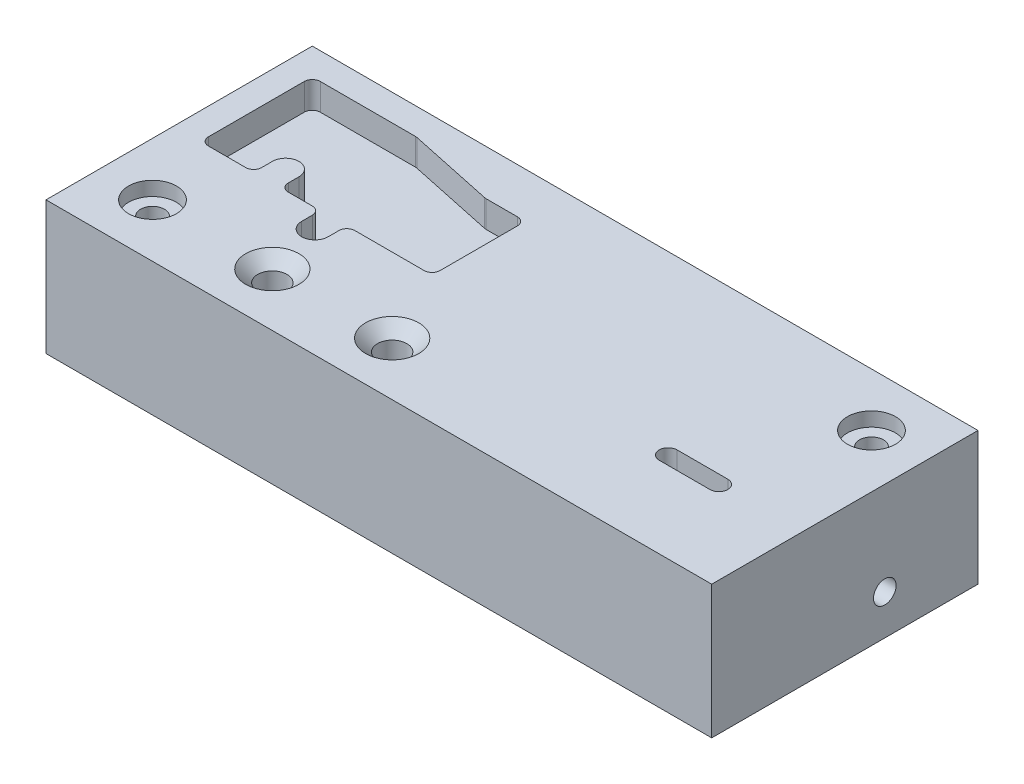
from build123d import *

# Parameters (mm, degrees)
SKETCH1_W                                            = 250
SKETCH1_H                                            = 100
BLOCK_STOCK_DEPTH                                    = 50
M10_TAPPED_HOLE1_D                                   = 8.5
M10_TAPPED_HOLE1_DEPTH                               = 25
M10_TAPPED_HOLE1_TIP                                 = 2.553657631
CBORE_FOR_M8_HEX_HEAD_BOLT1_D                        = 9
CBORE_FOR_M8_HEX_HEAD_BOLT1_CBORE_D                  = 18.011
CBORE_FOR_M8_HEX_HEAD_BOLT1_CBORE_DEPTH              = 5.3
POCKET_1_DEPTH                                       = 10
CSK_FOR_M10_CROSS_RECESS_FLAT_HEAD_SCREW_D           = 11
CSK_FOR_M10_CROSS_RECESS_FLAT_HEAD_SCREW_CSINK_D     = 20
CSK_FOR_M10_CROSS_RECESS_FLAT_HEAD_SCREW_CSINK_ANGLE = 90
SLOT_DEPTH                                           = 418.888285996


with BuildPart() as part:
    # Sketch1 → Block Stock (new body)
    with BuildSketch(Plane(origin=(0, 0, 0), x_dir=(1, 0, 0), z_dir=(0, 1, 0))):
        Rectangle(SKETCH1_W, SKETCH1_H)
    extrude(amount=BLOCK_STOCK_DEPTH)

    # M10 Tapped Hole1
    with Locations(Plane(origin=(125, 0, 0), x_dir=(0, 0, -1), z_dir=(1, 0, 0))):
        with Locations((15, 15)):
            Hole(M10_TAPPED_HOLE1_D / 2, depth=M10_TAPPED_HOLE1_DEPTH)
            with Locations((0, 0, -(M10_TAPPED_HOLE1_DEPTH + M10_TAPPED_HOLE1_TIP / 2))):  # 118° drill point
                Cone(0, M10_TAPPED_HOLE1_D / 2, M10_TAPPED_HOLE1_TIP, mode=Mode.SUBTRACT)

    # CBORE for M8 Hex Head Bolt1 (through all)
    with Locations(Plane(origin=(0, 50, 0), x_dir=(-1, 0, 0), z_dir=(0, 1, 0))):
        with Locations((105, 30), (-105, -30)):
            CounterBoreHole(CBORE_FOR_M8_HEX_HEAD_BOLT1_D / 2, CBORE_FOR_M8_HEX_HEAD_BOLT1_CBORE_D / 2, CBORE_FOR_M8_HEX_HEAD_BOLT1_CBORE_DEPTH)

    # Sketch2 → Pocket 1 (cut)
    with BuildSketch(Plane(origin=(0, 50, 0), x_dir=(1, 0, 0), z_dir=(0, 1, 0))):
        with BuildLine():
            Line((-112, 40), (-76.247723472, 40))
            ThreePointArc((-76.247723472, 40), (-75.934138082, 39.983565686), (-75.6239884, 39.934442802))
            Line((-75.6239884, 39.934442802), (-43.308422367, 33.065557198))
            ThreePointArc((-43.308422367, 33.065557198), (-42.998272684, 33.016434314), (-42.684687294, 33))
            Line((-42.684687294, 33), (-31, 33))
            ThreePointArc((-31, 33), (-28.878679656, 32.121320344), (-28, 30))
            Line((-28, 30), (-28, 1))
            ThreePointArc((-28, 1), (-28.878679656, -1.121320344), (-31, -2))
            Line((-31, -2), (-57, -2))
            ThreePointArc((-57, -2), (-59.121320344, -2.878679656), (-60, -5))
            Line((-60, -5), (-60, -9))
            ThreePointArc((-60, -9), (-65, -14), (-70, -9))
            Line((-70, -9), (-70, -5))
            ThreePointArc((-70, -5), (-70.878679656, -2.878679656), (-73, -2))
            Line((-73, -2), (-82, -2))
            ThreePointArc((-82, -2), (-84.121320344, -1.121320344), (-85, 1))
            Line((-85, 1), (-85, 5))
            ThreePointArc((-85, 5), (-90, 10), (-95, 5))
            Line((-95, 5), (-95, 1))
            ThreePointArc((-95, 1), (-95.878679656, -1.121320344), (-98, -2))
            Line((-98, -2), (-112, -2))
            ThreePointArc((-112, -2), (-114.121320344, -1.121320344), (-115, 1))
            Line((-115, 1), (-115, 37))
            ThreePointArc((-115, 37), (-114.121320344, 39.121320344), (-112, 40))
        make_face()
    extrude(amount=-POCKET_1_DEPTH, mode=Mode.SUBTRACT)

    # CSK for M10 Cross Recess Flat Head Screw (through all)
    with Locations(Plane(origin=(0, 50, 0), x_dir=(-1, 0, 0), z_dir=(0, 1, 0))):
        with Locations((15, 30), (60, 30)):
            CounterSinkHole(CSK_FOR_M10_CROSS_RECESS_FLAT_HEAD_SCREW_D / 2, CSK_FOR_M10_CROSS_RECESS_FLAT_HEAD_SCREW_CSINK_D / 2, counter_sink_angle=CSK_FOR_M10_CROSS_RECESS_FLAT_HEAD_SCREW_CSINK_ANGLE)

    # SlotSke → Slot (cut, through all)
    with BuildSketch(Plane(origin=(218.703654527, 50, 182.375595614), x_dir=(1, 0, 0), z_dir=(0, 1, 0))):
        with BuildLine():
            Line((-124.826827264, 162.822297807), (-143.876827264, 162.822297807))
            ThreePointArc((-143.876827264, 162.822297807), (-147.242327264, 166.187797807), (-143.876827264, 169.553297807))
            Line((-143.876827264, 169.553297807), (-124.826827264, 169.553297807))
            ThreePointArc((-124.826827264, 169.553297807), (-121.461327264, 166.187797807), (-124.826827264, 162.822297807))
        make_face()
    extrude(amount=-SLOT_DEPTH, mode=Mode.SUBTRACT)


solid = part.part
